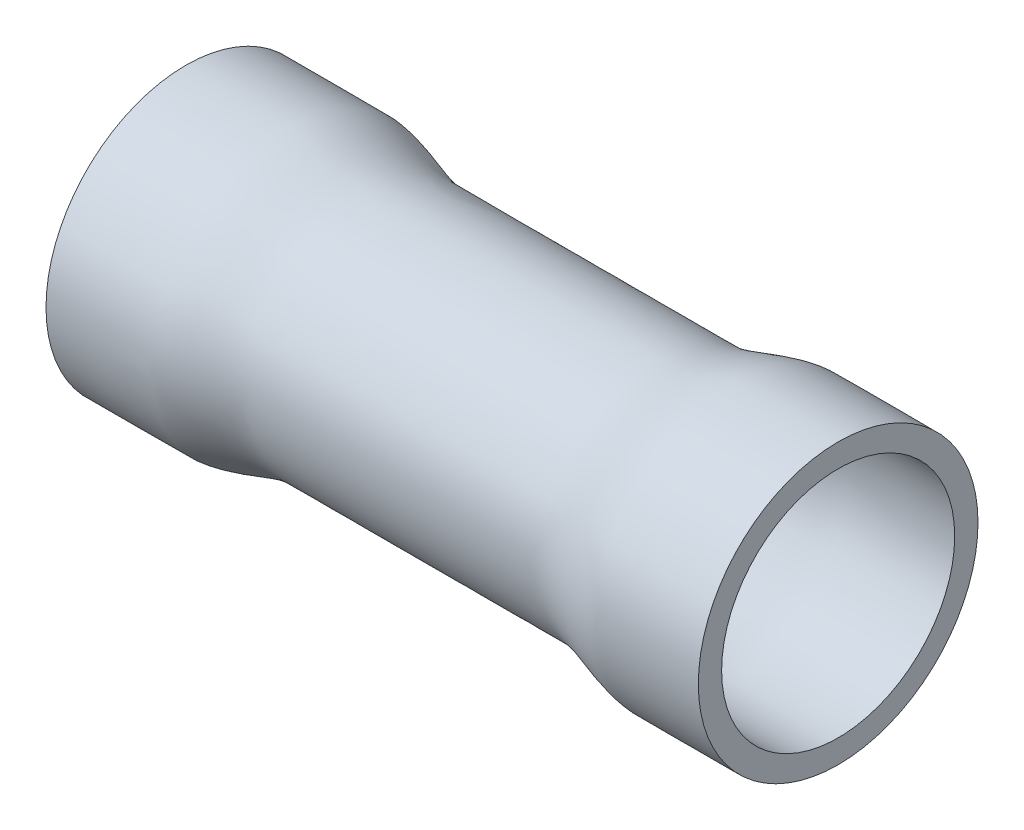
ISO-10303-21;
HEADER;
FILE_DESCRIPTION(('STEP AP214'),'2;1');
FILE_NAME('part.step','',(''),(''),'','','');
FILE_SCHEMA(('AUTOMOTIVE_DESIGN { 1 0 10303 214 1 1 1 1 }'));
ENDSEC;
DATA;
#1=APPLICATION_CONTEXT('core data for automotive mechanical design processes');
#2=APPLICATION_PROTOCOL_DEFINITION('international standard','automotive_design',2000,#1);
#3=PRODUCT_CONTEXT('',#1,'mechanical');
#4=PRODUCT('Part','Part','',(#3));
#5=PRODUCT_RELATED_PRODUCT_CATEGORY('part','',(#4));
#6=PRODUCT_DEFINITION_FORMATION('','',#4);
#7=PRODUCT_DEFINITION_CONTEXT('part definition',#1,'design');
#8=PRODUCT_DEFINITION('design','',#6,#7);
#9=PRODUCT_DEFINITION_SHAPE('','',#8);
#10=(LENGTH_UNIT() NAMED_UNIT(*) SI_UNIT(.MILLI.,.METRE.));
#11=(NAMED_UNIT(*) PLANE_ANGLE_UNIT() SI_UNIT($,.RADIAN.));
#12=(NAMED_UNIT(*) SI_UNIT($,.STERADIAN.) SOLID_ANGLE_UNIT());
#13=UNCERTAINTY_MEASURE_WITH_UNIT(LENGTH_MEASURE(1.E-05),#10,'distance_accuracy_value','');
#14=(GEOMETRIC_REPRESENTATION_CONTEXT(3) GLOBAL_UNCERTAINTY_ASSIGNED_CONTEXT((#13)) GLOBAL_UNIT_ASSIGNED_CONTEXT((#10,
#11,#12)) REPRESENTATION_CONTEXT('',''));
#15=CARTESIAN_POINT('',(0.,0.,0.));
#16=DIRECTION('',(0.,0.,1.));
#17=DIRECTION('',(1.,0.,0.));
#18=AXIS2_PLACEMENT_3D('',#15,#16,#17);
#19=CARTESIAN_POINT('',(7.,3.00119200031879,0.));
#20=CARTESIAN_POINT('',(6.475,3.00119200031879,0.));
#21=CARTESIAN_POINT('',(5.95,3.00119200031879,0.));
#22=CARTESIAN_POINT('',(5.425,3.00119200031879,0.));
#23=CARTESIAN_POINT('',(5.36536315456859,3.00119200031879,0.));
#24=CARTESIAN_POINT('',(5.24608946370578,3.00119200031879,0.));
#25=CARTESIAN_POINT('',(5.06717892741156,3.00119200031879,0.));
#26=CARTESIAN_POINT('',(4.94790523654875,3.00119200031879,0.));
#27=CARTESIAN_POINT('',(4.88826839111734,3.00119200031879,0.));
#28=CARTESIAN_POINT('',(4.85477000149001,3.00119200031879,0.));
#29=CARTESIAN_POINT('',(4.78777322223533,3.00119200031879,0.));
#30=CARTESIAN_POINT('',(4.68690488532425,2.99244212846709,0.));
#31=CARTESIAN_POINT('',(4.62090884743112,2.98090560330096,0.));
#32=CARTESIAN_POINT('',(4.58791082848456,2.9751373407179,0.));
#33=CARTESIAN_POINT('',(4.56797971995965,2.97165325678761,0.));
#34=CARTESIAN_POINT('',(4.52811750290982,2.96468508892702,0.));
#35=CARTESIAN_POINT('',(4.46869807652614,2.95207692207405,0.));
#36=CARTESIAN_POINT('',(4.42922439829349,2.94315848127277,0.));
#37=CARTESIAN_POINT('',(4.40953328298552,2.93850575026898,0.));
#38=CARTESIAN_POINT('',(4.09117518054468,2.86328225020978,0.));
#39=CARTESIAN_POINT('',(3.78660138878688,2.73790975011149,0.));
#40=CARTESIAN_POINT('',(3.47508126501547,2.66268625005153,0.));
#41=CARTESIAN_POINT('',(3.45611171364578,2.65810562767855,0.));
#42=CARTESIAN_POINT('',(3.41808491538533,2.64930755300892,0.));
#43=CARTESIAN_POINT('',(3.36084555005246,2.63683246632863,0.));
#44=CARTESIAN_POINT('',(3.32244306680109,2.6298644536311,0.));
#45=CARTESIAN_POINT('',(3.3032418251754,2.62638044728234,0.));
#46=CARTESIAN_POINT('',(3.27106311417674,2.62054171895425,0.));
#47=CARTESIAN_POINT('',(3.20670569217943,2.60886426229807,0.));
#48=CARTESIAN_POINT('',(3.10820161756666,2.6,0.));
#49=CARTESIAN_POINT('',(3.04279335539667,2.6,0.));
#50=CARTESIAN_POINT('',(3.01008922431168,2.6,0.));
#51=CARTESIAN_POINT('',(2.955723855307,2.6,0.));
#52=CARTESIAN_POINT('',(2.84699311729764,2.6,0.));
#53=CARTESIAN_POINT('',(2.6838970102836,2.6,0.));
#54=CARTESIAN_POINT('',(2.57516627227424,2.6,0.));
#55=CARTESIAN_POINT('',(2.52080090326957,2.6,0.));
#56=CARTESIAN_POINT('',(0.840266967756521,2.6,0.));
#57=CARTESIAN_POINT('',(-0.840266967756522,2.6,0.));
#58=CARTESIAN_POINT('',(-2.52080090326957,2.6,0.));
#59=CARTESIAN_POINT('',(-2.57516627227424,2.6,0.));
#60=CARTESIAN_POINT('',(-2.6838970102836,2.6,0.));
#61=CARTESIAN_POINT('',(-2.84699311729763,2.6,0.));
#62=CARTESIAN_POINT('',(-2.95572385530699,2.6,0.));
#63=CARTESIAN_POINT('',(-3.01008922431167,2.6,0.));
#64=CARTESIAN_POINT('',(-3.04279335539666,2.6,0.));
#65=CARTESIAN_POINT('',(-3.10820161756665,2.6,0.));
#66=CARTESIAN_POINT('',(-3.20670569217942,2.60886426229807,0.));
#67=CARTESIAN_POINT('',(-3.27106311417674,2.62054171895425,0.));
#68=CARTESIAN_POINT('',(-3.3032418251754,2.62638044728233,0.));
#69=CARTESIAN_POINT('',(-3.32244306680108,2.6298644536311,0.));
#70=CARTESIAN_POINT('',(-3.36084555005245,2.63683246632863,0.));
#71=CARTESIAN_POINT('',(-3.41808491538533,2.64930755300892,0.));
#72=CARTESIAN_POINT('',(-3.45611171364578,2.65810562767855,0.));
#73=CARTESIAN_POINT('',(-3.47508126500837,2.66268625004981,0.));
#74=CARTESIAN_POINT('',(-3.78660138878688,2.73790975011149,0.));
#75=CARTESIAN_POINT('',(-4.09117518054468,2.86328225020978,0.));
#76=CARTESIAN_POINT('',(-4.40953328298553,2.93850575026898,0.));
#77=CARTESIAN_POINT('',(-4.42922439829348,2.94315848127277,0.));
#78=CARTESIAN_POINT('',(-4.46869807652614,2.95207692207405,0.));
#79=CARTESIAN_POINT('',(-4.52811750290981,2.96468508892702,0.));
#80=CARTESIAN_POINT('',(-4.56797971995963,2.97165325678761,0.));
#81=CARTESIAN_POINT('',(-4.58791082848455,2.9751373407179,0.));
#82=CARTESIAN_POINT('',(-4.62090884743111,2.98090560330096,0.));
#83=CARTESIAN_POINT('',(-4.68690488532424,2.99244212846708,0.));
#84=CARTESIAN_POINT('',(-4.78777322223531,3.00119200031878,0.));
#85=CARTESIAN_POINT('',(-4.85477000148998,3.00119200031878,0.));
#86=CARTESIAN_POINT('',(-4.88826839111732,3.00119200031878,0.));
#87=CARTESIAN_POINT('',(-4.94790523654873,3.00119200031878,0.));
#88=CARTESIAN_POINT('',(-5.06717892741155,3.00119200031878,0.));
#89=CARTESIAN_POINT('',(-5.24608946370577,3.00119200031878,0.));
#90=CARTESIAN_POINT('',(-5.36536315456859,3.00119200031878,0.));
#91=CARTESIAN_POINT('',(-5.425,3.00119200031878,0.));
#92=CARTESIAN_POINT('',(-5.95,3.00119200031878,0.));
#93=CARTESIAN_POINT('',(-6.475,3.00119200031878,0.));
#94=CARTESIAN_POINT('',(-7.,3.00119200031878,0.));
#95=B_SPLINE_CURVE_WITH_KNOTS('',3,(#19,#20,#21,#22,#23,#24,#25,#26,#27,#28,#29,#30,#31,#32,#33,
#34,#35,#36,#37,#38,#39,#40,#41,#42,#43,#44,#45,#46,#47,#48,#49,#50,#51,#52,#53,#54,#55,#56,#57,
#58,#59,#60,#61,#62,#63,#64,#65,#66,#67,#68,#69,#70,#71,#72,#73,#74,#75,#76,#77,#78,#79,#80,#81,
#82,#83,#84,#85,#86,#87,#88,#89,#90,#91,#92,#93,#94),.UNSPECIFIED.,.F.,.F.,(4,3,1,1,3,1,1,3,1,1,
3,3,1,1,3,1,1,3,1,1,3,3,1,1,3,1,1,3,1,1,3,3,1,1,3,1,1,3,1,1,3,4),(0.,0.110464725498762,
0.123012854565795,0.135560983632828,0.148109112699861,0.155157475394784,0.162205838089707,
0.16925420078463,0.173511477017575,0.177768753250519,0.182026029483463,0.250855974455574,
0.255047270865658,0.259238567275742,0.263429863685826,0.270453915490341,0.277477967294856,
0.284502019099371,0.29617837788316,0.307854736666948,0.319531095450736,0.680468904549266,
0.692145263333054,0.703821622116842,0.71549798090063,0.722522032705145,0.72954608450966,
0.736570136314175,0.740761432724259,0.744952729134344,0.749144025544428,0.817973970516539,
0.822231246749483,0.826488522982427,0.830745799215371,0.837794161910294,0.844842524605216,
0.851890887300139,0.864439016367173,0.876987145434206,0.88953527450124,1.),.UNSPECIFIED.);
#96=CARTESIAN_POINT('',(-12.5,0.,0.));
#97=DIRECTION('',(-1.,0.,0.));
#98=AXIS1_PLACEMENT('',#96,#97);
#99=SURFACE_OF_REVOLUTION('',#95,#98);
#100=CARTESIAN_POINT('',(-7.,0.,0.));
#101=DIRECTION('',(-1.,0.,0.));
#102=DIRECTION('',(0.,0.,1.));
#103=AXIS2_PLACEMENT_3D('',#100,#101,#102);
#104=CIRCLE('',#103,3.00119200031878);
#105=CARTESIAN_POINT('',(-7.,0.,3.00119200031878));
#106=VERTEX_POINT('',#105);
#107=EDGE_CURVE('E55',#106,#106,#104,.T.);
#108=ORIENTED_EDGE('',*,*,#107,.F.);
#109=EDGE_LOOP('',(#108));
#110=FACE_BOUND('',#109,.T.);
#111=CARTESIAN_POINT('',(7.,0.,0.));
#112=DIRECTION('',(-1.,0.,0.));
#113=DIRECTION('',(0.,0.,1.));
#114=AXIS2_PLACEMENT_3D('',#111,#112,#113);
#115=CIRCLE('',#114,3.00119200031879);
#116=CARTESIAN_POINT('',(7.,0.,3.00119200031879));
#117=VERTEX_POINT('',#116);
#118=EDGE_CURVE('E11',#117,#117,#115,.T.);
#119=ORIENTED_EDGE('',*,*,#118,.T.);
#120=EDGE_LOOP('',(#119));
#121=FACE_BOUND('',#120,.T.);
#122=ADVANCED_FACE('F40',(#110,#121),#99,.T.);
#123=CARTESIAN_POINT('',(6.99999999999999,3.00119200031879,0.));
#124=DIRECTION('',(-1.,0.,0.));
#125=DIRECTION('',(0.,0.,1.));
#126=AXIS2_PLACEMENT_3D('',#123,#124,#125);
#127=PLANE('',#126);
#128=ORIENTED_EDGE('',*,*,#118,.F.);
#129=EDGE_LOOP('',(#128));
#130=FACE_BOUND('',#129,.T.);
#131=CARTESIAN_POINT('',(6.99999999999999,0.,0.));
#132=DIRECTION('',(-1.,0.,0.));
#133=DIRECTION('',(0.,0.,1.));
#134=AXIS2_PLACEMENT_3D('',#131,#132,#133);
#135=CIRCLE('',#134,2.50119200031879);
#136=CARTESIAN_POINT('',(6.99999999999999,0.,2.50119200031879));
#137=VERTEX_POINT('',#136);
#138=EDGE_CURVE('E47',#137,#137,#135,.T.);
#139=ORIENTED_EDGE('',*,*,#138,.T.);
#140=EDGE_LOOP('',(#139));
#141=FACE_BOUND('',#140,.T.);
#142=ADVANCED_FACE('F74',(#130,#141),#127,.F.);
#143=CARTESIAN_POINT('',(-6.99999999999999,2.50119200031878,0.));
#144=CARTESIAN_POINT('',(-6.47499999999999,2.50119200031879,0.));
#145=CARTESIAN_POINT('',(-5.94999999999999,2.50119200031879,0.));
#146=CARTESIAN_POINT('',(-5.425,2.50119200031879,0.));
#147=CARTESIAN_POINT('',(-5.36536315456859,2.50119200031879,0.));
#148=CARTESIAN_POINT('',(-5.24608946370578,2.50119200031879,0.));
#149=CARTESIAN_POINT('',(-5.06717892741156,2.50119200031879,0.));
#150=CARTESIAN_POINT('',(-4.94790523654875,2.50119200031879,0.));
#151=CARTESIAN_POINT('',(-4.88826839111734,2.50119200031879,0.));
#152=CARTESIAN_POINT('',(-4.85477000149,2.50119200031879,0.));
#153=CARTESIAN_POINT('',(-4.78777322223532,2.50119200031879,0.));
#154=CARTESIAN_POINT('',(-4.68690488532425,2.49244212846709,0.));
#155=CARTESIAN_POINT('',(-4.62090884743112,2.48090560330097,0.));
#156=CARTESIAN_POINT('',(-4.58791082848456,2.47513734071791,0.));
#157=CARTESIAN_POINT('',(-4.56797971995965,2.47165325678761,0.));
#158=CARTESIAN_POINT('',(-4.52811750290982,2.46468508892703,0.));
#159=CARTESIAN_POINT('',(-4.46869807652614,2.45207692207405,0.));
#160=CARTESIAN_POINT('',(-4.42922439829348,2.44315848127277,0.));
#161=CARTESIAN_POINT('',(-4.40953328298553,2.43850575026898,0.));
#162=CARTESIAN_POINT('',(-4.09117518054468,2.36328225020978,0.));
#163=CARTESIAN_POINT('',(-3.78660138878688,2.23790975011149,0.));
#164=CARTESIAN_POINT('',(-3.47508126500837,2.16268625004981,0.));
#165=CARTESIAN_POINT('',(-3.45611171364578,2.15810562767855,0.));
#166=CARTESIAN_POINT('',(-3.41808491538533,2.14930755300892,0.));
#167=CARTESIAN_POINT('',(-3.36084555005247,2.13683246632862,0.));
#168=CARTESIAN_POINT('',(-3.3224430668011,2.1298644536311,0.));
#169=CARTESIAN_POINT('',(-3.30324182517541,2.12638044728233,0.));
#170=CARTESIAN_POINT('',(-3.27106311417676,2.12054171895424,0.));
#171=CARTESIAN_POINT('',(-3.20670569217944,2.10886426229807,0.));
#172=CARTESIAN_POINT('',(-3.10820161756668,2.1,0.));
#173=CARTESIAN_POINT('',(-3.0427933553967,2.1,0.));
#174=CARTESIAN_POINT('',(-3.01008922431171,2.1,0.));
#175=CARTESIAN_POINT('',(-2.95572385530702,2.1,0.));
#176=CARTESIAN_POINT('',(-2.84699311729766,2.1,0.));
#177=CARTESIAN_POINT('',(-2.68389701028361,2.1,0.));
#178=CARTESIAN_POINT('',(-2.57516627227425,2.1,0.));
#179=CARTESIAN_POINT('',(-2.52080090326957,2.1,0.));
#180=CARTESIAN_POINT('',(-0.840266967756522,2.1,0.));
#181=CARTESIAN_POINT('',(0.840266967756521,2.1,0.));
#182=CARTESIAN_POINT('',(2.52080090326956,2.1,0.));
#183=CARTESIAN_POINT('',(2.57516627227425,2.1,0.));
#184=CARTESIAN_POINT('',(2.68389701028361,2.1,0.));
#185=CARTESIAN_POINT('',(2.84699311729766,2.1,0.));
#186=CARTESIAN_POINT('',(2.95572385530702,2.1,0.));
#187=CARTESIAN_POINT('',(3.0100892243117,2.1,0.));
#188=CARTESIAN_POINT('',(3.0427933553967,2.1,0.));
#189=CARTESIAN_POINT('',(3.10820161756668,2.1,0.));
#190=CARTESIAN_POINT('',(3.20670569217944,2.10886426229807,0.));
#191=CARTESIAN_POINT('',(3.27106311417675,2.12054171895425,0.));
#192=CARTESIAN_POINT('',(3.30324182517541,2.12638044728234,0.));
#193=CARTESIAN_POINT('',(3.3224430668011,2.1298644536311,0.));
#194=CARTESIAN_POINT('',(3.36084555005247,2.13683246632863,0.));
#195=CARTESIAN_POINT('',(3.41808491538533,2.14930755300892,0.));
#196=CARTESIAN_POINT('',(3.45611171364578,2.15810562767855,0.));
#197=CARTESIAN_POINT('',(3.47508126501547,2.16268625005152,0.));
#198=CARTESIAN_POINT('',(3.78660138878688,2.23790975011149,0.));
#199=CARTESIAN_POINT('',(4.09117518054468,2.36328225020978,0.));
#200=CARTESIAN_POINT('',(4.40953328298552,2.43850575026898,0.));
#201=CARTESIAN_POINT('',(4.42922439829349,2.44315848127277,0.));
#202=CARTESIAN_POINT('',(4.46869807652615,2.45207692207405,0.));
#203=CARTESIAN_POINT('',(4.52811750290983,2.46468508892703,0.));
#204=CARTESIAN_POINT('',(4.56797971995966,2.47165325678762,0.));
#205=CARTESIAN_POINT('',(4.58791082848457,2.47513734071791,0.));
#206=CARTESIAN_POINT('',(4.62090884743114,2.48090560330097,0.));
#207=CARTESIAN_POINT('',(4.68690488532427,2.49244212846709,0.));
#208=CARTESIAN_POINT('',(4.78777322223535,2.50119200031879,0.));
#209=CARTESIAN_POINT('',(4.85477000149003,2.50119200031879,0.));
#210=CARTESIAN_POINT('',(4.88826839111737,2.50119200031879,0.));
#211=CARTESIAN_POINT('',(4.94790523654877,2.50119200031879,0.));
#212=CARTESIAN_POINT('',(5.06717892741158,2.50119200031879,0.));
#213=CARTESIAN_POINT('',(5.24608946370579,2.50119200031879,0.));
#214=CARTESIAN_POINT('',(5.36536315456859,2.50119200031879,0.));
#215=CARTESIAN_POINT('',(5.425,2.50119200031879,0.));
#216=CARTESIAN_POINT('',(5.94999999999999,2.50119200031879,0.));
#217=CARTESIAN_POINT('',(6.47499999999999,2.50119200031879,0.));
#218=CARTESIAN_POINT('',(6.99999999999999,2.50119200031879,0.));
#219=B_SPLINE_CURVE_WITH_KNOTS('',3,(#143,#144,#145,#146,#147,#148,#149,#150,#151,#152,#153,
#154,#155,#156,#157,#158,#159,#160,#161,#162,#163,#164,#165,#166,#167,#168,#169,#170,#171,#172,
#173,#174,#175,#176,#177,#178,#179,#180,#181,#182,#183,#184,#185,#186,#187,#188,#189,#190,#191,
#192,#193,#194,#195,#196,#197,#198,#199,#200,#201,#202,#203,#204,#205,#206,#207,#208,#209,#210,
#211,#212,#213,#214,#215,#216,#217,#218),.UNSPECIFIED.,.F.,.F.,(4,3,1,1,3,1,1,3,1,1,3,3,1,1,3,1,
1,3,1,1,3,3,1,1,3,1,1,3,1,1,3,3,1,1,3,1,1,3,1,1,3,4),(0.,0.11046472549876,0.123012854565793,
0.135560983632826,0.148109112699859,0.155157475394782,0.162205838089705,0.169254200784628,
0.173511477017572,0.177768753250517,0.182026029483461,0.250855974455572,0.255047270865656,
0.25923856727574,0.263429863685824,0.270453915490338,0.277477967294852,0.284502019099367,
0.296178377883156,0.307854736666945,0.319531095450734,0.680468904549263,0.692145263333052,
0.703821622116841,0.71549798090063,0.722522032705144,0.729546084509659,0.736570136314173,
0.740761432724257,0.744952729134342,0.749144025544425,0.817973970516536,0.822231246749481,
0.826488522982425,0.83074579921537,0.837794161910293,0.844842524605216,0.85189088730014,
0.864439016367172,0.876987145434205,0.889535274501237,1.),.UNSPECIFIED.);
#220=CARTESIAN_POINT('',(-12.5,0.,0.));
#221=DIRECTION('',(-1.,0.,0.));
#222=AXIS1_PLACEMENT('',#220,#221);
#223=SURFACE_OF_REVOLUTION('',#219,#222);
#224=ORIENTED_EDGE('',*,*,#138,.F.);
#225=EDGE_LOOP('',(#224));
#226=FACE_BOUND('',#225,.T.);
#227=CARTESIAN_POINT('',(-6.99999999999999,0.,0.));
#228=DIRECTION('',(-1.,0.,0.));
#229=DIRECTION('',(0.,0.,1.));
#230=AXIS2_PLACEMENT_3D('',#227,#228,#229);
#231=CIRCLE('',#230,2.50119200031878);
#232=CARTESIAN_POINT('',(-6.99999999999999,0.,2.50119200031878));
#233=VERTEX_POINT('',#232);
#234=EDGE_CURVE('E51',#233,#233,#231,.T.);
#235=ORIENTED_EDGE('',*,*,#234,.T.);
#236=EDGE_LOOP('',(#235));
#237=FACE_BOUND('',#236,.T.);
#238=ADVANCED_FACE('F70',(#226,#237),#223,.T.);
#239=CARTESIAN_POINT('',(-6.99999999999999,3.00119200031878,0.));
#240=DIRECTION('',(1.,0.,0.));
#241=DIRECTION('',(0.,0.,-1.));
#242=AXIS2_PLACEMENT_3D('',#239,#240,#241);
#243=PLANE('',#242);
#244=ORIENTED_EDGE('',*,*,#234,.F.);
#245=EDGE_LOOP('',(#244));
#246=FACE_BOUND('',#245,.T.);
#247=ORIENTED_EDGE('',*,*,#107,.T.);
#248=EDGE_LOOP('',(#247));
#249=FACE_BOUND('',#248,.T.);
#250=ADVANCED_FACE('F73',(#246,#249),#243,.F.);
#251=CLOSED_SHELL('',(#122,#142,#238,#250));
#252=MANIFOLD_SOLID_BREP('B2',#251);
#253=CARTESIAN_POINT('',(-3.,0.,0.));
#254=DIRECTION('',(1.,0.,0.));
#255=DIRECTION('',(0.,0.,-1.));
#256=AXIS2_PLACEMENT_3D('',#253,#254,#255);
#257=CYLINDRICAL_SURFACE('',#256,2.);
#258=CARTESIAN_POINT('',(-3.,0.,0.));
#259=DIRECTION('',(1.,0.,0.));
#260=DIRECTION('',(0.,0.,-1.));
#261=AXIS2_PLACEMENT_3D('',#258,#259,#260);
#262=CIRCLE('',#261,2.);
#263=CARTESIAN_POINT('',(-3.,0.,-2.));
#264=VERTEX_POINT('',#263);
#265=EDGE_CURVE('E39',#264,#264,#262,.T.);
#266=ORIENTED_EDGE('',*,*,#265,.T.);
#267=EDGE_LOOP('',(#266));
#268=FACE_BOUND('',#267,.T.);
#269=CARTESIAN_POINT('',(3.,0.,0.));
#270=DIRECTION('',(1.,0.,0.));
#271=DIRECTION('',(0.,0.,-1.));
#272=AXIS2_PLACEMENT_3D('',#269,#270,#271);
#273=CIRCLE('',#272,2.);
#274=CARTESIAN_POINT('',(3.,0.,-2.));
#275=VERTEX_POINT('',#274);
#276=EDGE_CURVE('E125',#275,#275,#273,.T.);
#277=ORIENTED_EDGE('',*,*,#276,.F.);
#278=EDGE_LOOP('',(#277));
#279=FACE_BOUND('',#278,.T.);
#280=ADVANCED_FACE('F115',(#268,#279),#257,.T.);
#281=CARTESIAN_POINT('',(-3.,0.,0.));
#282=DIRECTION('',(1.,0.,0.));
#283=DIRECTION('',(0.,0.,-1.));
#284=AXIS2_PLACEMENT_3D('',#281,#282,#283);
#285=PLANE('',#284);
#286=CARTESIAN_POINT('',(-3.,0.,0.));
#287=DIRECTION('',(1.,0.,0.));
#288=DIRECTION('',(0.,0.,-1.));
#289=AXIS2_PLACEMENT_3D('',#286,#287,#288);
#290=CIRCLE('',#289,1.5);
#291=CARTESIAN_POINT('',(-3.,0.,-1.5));
#292=VERTEX_POINT('',#291);
#293=EDGE_CURVE('E121',#292,#292,#290,.T.);
#294=ORIENTED_EDGE('',*,*,#293,.T.);
#295=EDGE_LOOP('',(#294));
#296=FACE_BOUND('',#295,.T.);
#297=ORIENTED_EDGE('',*,*,#265,.F.);
#298=EDGE_LOOP('',(#297));
#299=FACE_BOUND('',#298,.T.);
#300=ADVANCED_FACE('F144',(#296,#299),#285,.F.);
#301=CARTESIAN_POINT('',(-3.,0.,0.));
#302=DIRECTION('',(1.,0.,0.));
#303=DIRECTION('',(0.,0.,-1.));
#304=AXIS2_PLACEMENT_3D('',#301,#302,#303);
#305=CYLINDRICAL_SURFACE('',#304,1.5);
#306=ORIENTED_EDGE('',*,*,#293,.F.);
#307=EDGE_LOOP('',(#306));
#308=FACE_BOUND('',#307,.T.);
#309=CARTESIAN_POINT('',(3.,0.,0.));
#310=DIRECTION('',(1.,0.,0.));
#311=DIRECTION('',(0.,0.,-1.));
#312=AXIS2_PLACEMENT_3D('',#309,#310,#311);
#313=CIRCLE('',#312,1.5);
#314=CARTESIAN_POINT('',(3.,0.,-1.5));
#315=VERTEX_POINT('',#314);
#316=EDGE_CURVE('E129',#315,#315,#313,.T.);
#317=ORIENTED_EDGE('',*,*,#316,.T.);
#318=EDGE_LOOP('',(#317));
#319=FACE_BOUND('',#318,.T.);
#320=ADVANCED_FACE('F135',(#308,#319),#305,.F.);
#321=CARTESIAN_POINT('',(3.,0.,0.));
#322=DIRECTION('',(1.,0.,0.));
#323=DIRECTION('',(0.,0.,-1.));
#324=AXIS2_PLACEMENT_3D('',#321,#322,#323);
#325=PLANE('',#324);
#326=ORIENTED_EDGE('',*,*,#276,.T.);
#327=EDGE_LOOP('',(#326));
#328=FACE_BOUND('',#327,.T.);
#329=ORIENTED_EDGE('',*,*,#316,.F.);
#330=EDGE_LOOP('',(#329));
#331=FACE_BOUND('',#330,.T.);
#332=ADVANCED_FACE('F137',(#328,#331),#325,.T.);
#333=CLOSED_SHELL('',(#280,#300,#320,#332));
#334=MANIFOLD_SOLID_BREP('B6',#333);
#335=ADVANCED_BREP_SHAPE_REPRESENTATION('',(#18,#252,#334),#14);
#336=SHAPE_DEFINITION_REPRESENTATION(#9,#335);
ENDSEC;
END-ISO-10303-21;
